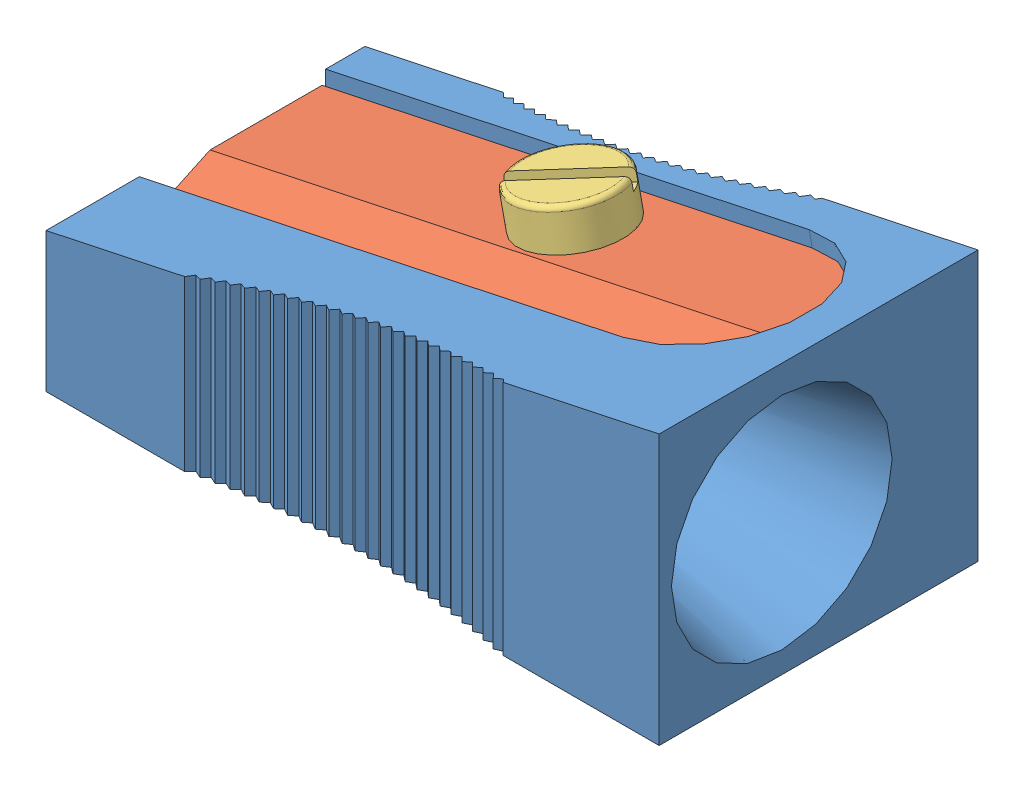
SolidWorks assembly SW3dPS-pencil sharpener.SLDASM, configuration Default (file format 7000). Lengths in mm.
Overall size (25.15 11 13).
3 component instances, 3 part files, 5 mates.
Components (placement in the parent):
- SW3dPS-pencil sharpener_body-1: SW3dPS-pencil sharpener_body.SLDPRT [Default] at (-0.1874 21.5311 -6.5) size (25 11 13)
- SW3dPS-pencil sharpener_blade-1: SW3dPS-pencil sharpener_blade.SLDPRT [Default] at (-39.9013 11.7607 -19.346) x (-0.978148 -0.207912 0) z (0 0 -1) size (24.23 0.7 6.37)
- SW3dPS-pencil sharpener_screw-1: SW3dPS-pencil sharpener_screw.SLDPRT [Default] at (-11.7854 14.3632 -2.5) x (0.537947 0.114344 0.835188) z (-0.816937 -0.173645 0.549965) size (4 5.61 4)
Mates (geometry in assembly coordinates):
- Concentric1: concentric aligned: cylinder of SW3dPS-pencil sharpener_body-1 through (-12.4715 17.591 -2.5) axis (-0.207912 0.978148 0) radius 1.025; circle of SW3dPS-pencil sharpener_blade-1
- Parallel1: parallel anti-aligned: plane of SW3dPS-pencil sharpener_body-1 through (-5.1991 19.1368 -4.9) normal (0 0 1); plane of SW3dPS-pencil sharpener_blade-1 through (-5.3447 19.8215 -4.9) normal (0 0 -1)
- Coincident1: coincident anti-aligned: plane of SW3dPS-pencil sharpener_body-1 through (-5.1991 19.1368 -1.1) normal (-0.207912 0.978148 0); plane of SW3dPS-pencil sharpener_blade-1 through (-5.1991 19.1368 -1.1) normal (0.207912 -0.978148 0)
- Concentric2: concentric aligned: circle of SW3dPS-pencil sharpener_blade-1; cylinder of SW3dPS-pencil sharpener_screw-1 through (-19.8069 52.1012 -2.5) axis (-0.207912 0.978148 0) radius 1.25
- Coincident2: coincident anti-aligned: plane of SW3dPS-pencil sharpener_blade-1 through (-5.3447 19.8215 -1.1) normal (-0.207912 0.978148 0); plane of SW3dPS-pencil sharpener_screw-1 through (-11.9446 18.4187 -1.456) normal (0.207912 -0.978148 0)
